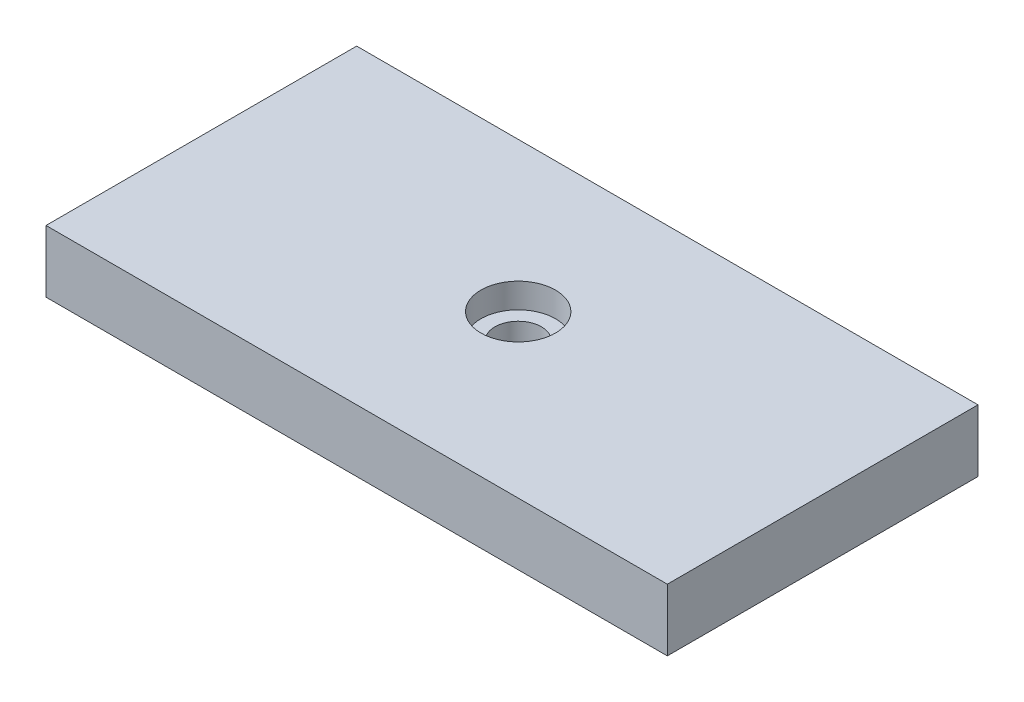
from build123d import *

# Parameters (mm, degrees)
SKETCH1_W                       = 100
SKETCH1_H                       = 50
EXTRUDE1_DEPTH                  = 10
CBORE_FOR_M3_SBHCS1_D           = 7.5
CBORE_FOR_M3_SBHCS1_CBORE_D     = 12
CBORE_FOR_M3_SBHCS1_CBORE_DEPTH = 4


with BuildPart() as part:
    # Sketch1 → Extrude1 (new body)
    with BuildSketch(Plane(origin=(0, 0, 0), x_dir=(1, 0, 0), z_dir=(0, 1, 0))):
        with Locations((50, 25)):
            Rectangle(SKETCH1_W, SKETCH1_H)
    extrude(amount=EXTRUDE1_DEPTH)

    # CBORE for M3 SBHCS1 (through all)
    with Locations(Plane(origin=(50, 10, -26), x_dir=(0, 0, 1), z_dir=(0, 1, 0))):
        with Locations((0, 0)):
            CounterBoreHole(CBORE_FOR_M3_SBHCS1_D / 2, CBORE_FOR_M3_SBHCS1_CBORE_D / 2, CBORE_FOR_M3_SBHCS1_CBORE_DEPTH)


solid = part.part
